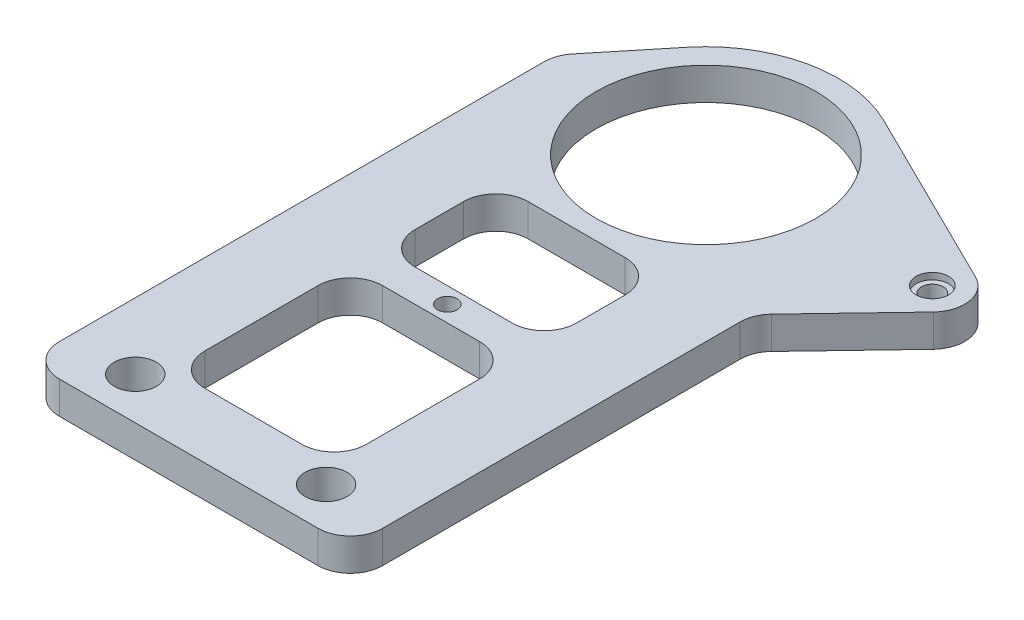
from build123d import *

# Parameters (mm, degrees)
ESQUISSE1_R             = 2.5
ESQUISSE1_R_2           = 34
ESQUISSE1_R_3           = 6.3
ESQUISSE1_R_4           = 2.9
BASE_EXTRUSION_DEPTH    = 10
ESQUISSE2_R             = 27.5
ESQUISSE2_R_2           = 3
ESQUISSE2_R_3           = 6.5
ENL_V_MAT_EXTRU_2_DEPTH = 180.164728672
ESQUISSE3_R             = 5
ENL_V_MAT_EXTRU_3_DEPTH = 2
ESQUISSE4_R             = 3.375
ENL_V_MAT_EXTRU_4_DEPTH = 180.164728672


with BuildPart() as part:
    # Esquisse1 → Base-Extrusion (new body)
    with BuildSketch(Plane(origin=(0, 0, 0), x_dir=(1, 0, 0), z_dir=(0, 1, 0))):
        with BuildLine():
            Line((-50, -150), (-50, 0))
            ThreePointArc((-50, 0), (-49.420721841, 3.354101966), (-47.75, 6.31961233))
            Line((-47.75, 6.31961233), (-31.775, 25.910410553))
            ThreePointArc((-31.775, 25.910410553), (-8.705826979, 40.065054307), (18.157142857, 36.760279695))
            Line((18.157142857, 36.760279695), (74.428571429, 8.965921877))
            ThreePointArc((74.428571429, 8.965921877), (79.847611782, 1.7391211), (77.231724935, -6.906674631))
            Line((77.231724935, -6.906674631), (52.768275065, -32.52145307))
            ThreePointArc((52.768275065, -32.52145307), (50.717832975, -35.707727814), (50, -39.428127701))
            Line((50, -39.428127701), (50, -150))
            ThreePointArc((50, -150), (47.071067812, -157.071067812), (40, -160))
            Line((40, -160), (-40, -160))
            ThreePointArc((-40, -160), (-47.071067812, -157.071067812), (-50, -150))
        make_face()
        with Locations(Location((70, 0, 0), (0, 0, 270))):
            Circle(ESQUISSE1_R, mode=Mode.SUBTRACT)
        with Locations(Location((0, 0, 0), (0, 0, 270))):
            Circle(ESQUISSE1_R_2, mode=Mode.SUBTRACT)
        with Locations(Location((29.5, -147, 0), (0, 0, 270))):
            Circle(ESQUISSE1_R_3, mode=Mode.SUBTRACT)
        with Locations(Location((-29.5, -147, 0), (0, 0, 270))):
            Circle(ESQUISSE1_R_3, mode=Mode.SUBTRACT)
        with Locations(Location((0, -80, 0), (0, 0, 270))):
            Circle(ESQUISSE1_R_4, mode=Mode.SUBTRACT)
        with BuildLine():
            Line((-15, -75), (15, -75))
            ThreePointArc((15, -75), (22.071067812, -72.071067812), (25, -65))
            Line((25, -65), (25, -50))
            ThreePointArc((25, -50), (22.071067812, -42.928932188), (15, -40))
            Line((15, -40), (-15, -40))
            ThreePointArc((-15, -40), (-22.071067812, -42.928932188), (-25, -50))
            Line((-25, -50), (-25, -65))
            ThreePointArc((-25, -65), (-22.071067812, -72.071067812), (-15, -75))
        make_face(mode=Mode.SUBTRACT)
        with BuildLine():
            Line((25, -130), (25, -95))
            ThreePointArc((25, -95), (22.071067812, -87.928932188), (15, -85))
            Line((15, -85), (-15, -85))
            ThreePointArc((-15, -85), (-22.071067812, -87.928932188), (-25, -95))
            Line((-25, -95), (-25, -130))
            ThreePointArc((-25, -130), (-22.071067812, -137.071067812), (-15, -140))
            Line((-15, -140), (15, -140))
            ThreePointArc((15, -140), (22.071067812, -137.071067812), (25, -130))
        make_face(mode=Mode.SUBTRACT)
    extrude(amount=BASE_EXTRUSION_DEPTH)

    # Esquisse2 → Enl_v. mat.-Extru.2 (cut, through all)
    with BuildSketch(Plane(origin=(0, 0, 0), x_dir=(1, 0, 0), z_dir=(0, 1, 0))):
        Circle(ESQUISSE2_R)
        with Locations(Location((0, -80, 0), (0, 0, 270))):
            Circle(ESQUISSE2_R_2)
        with Locations(Location((29.5, -147, 0), (0, 0, 270))):
            Circle(ESQUISSE2_R_3)
        with Locations(Location((-29.5, -147, 0), (0, 0, 270))):
            Circle(ESQUISSE2_R_3)
    extrude(amount=ENL_V_MAT_EXTRU_2_DEPTH, mode=Mode.SUBTRACT)

    # Esquisse3 → Enl_v. mat.-Extru.3 (cut)
    with BuildSketch(Plane(origin=(0, 10, 0), x_dir=(-1, 0, 0), z_dir=(0, 1, 0))):
        with Locations(Location((-70, 0, 0), (0, 0, 90))):
            Circle(ESQUISSE3_R)
    extrude(amount=-ENL_V_MAT_EXTRU_3_DEPTH, mode=Mode.SUBTRACT)

    # Esquisse4 → Enl_v. mat.-Extru.4 (cut, through all)
    with BuildSketch(Plane(origin=(0, 10, 0), x_dir=(-1, 0, 0), z_dir=(0, 1, 0))):
        with Locations(Location((-70, 0, 0), (0, 0, 90))):
            Circle(ESQUISSE4_R)
    extrude(amount=-ENL_V_MAT_EXTRU_4_DEPTH, mode=Mode.SUBTRACT)


solid = part.part
